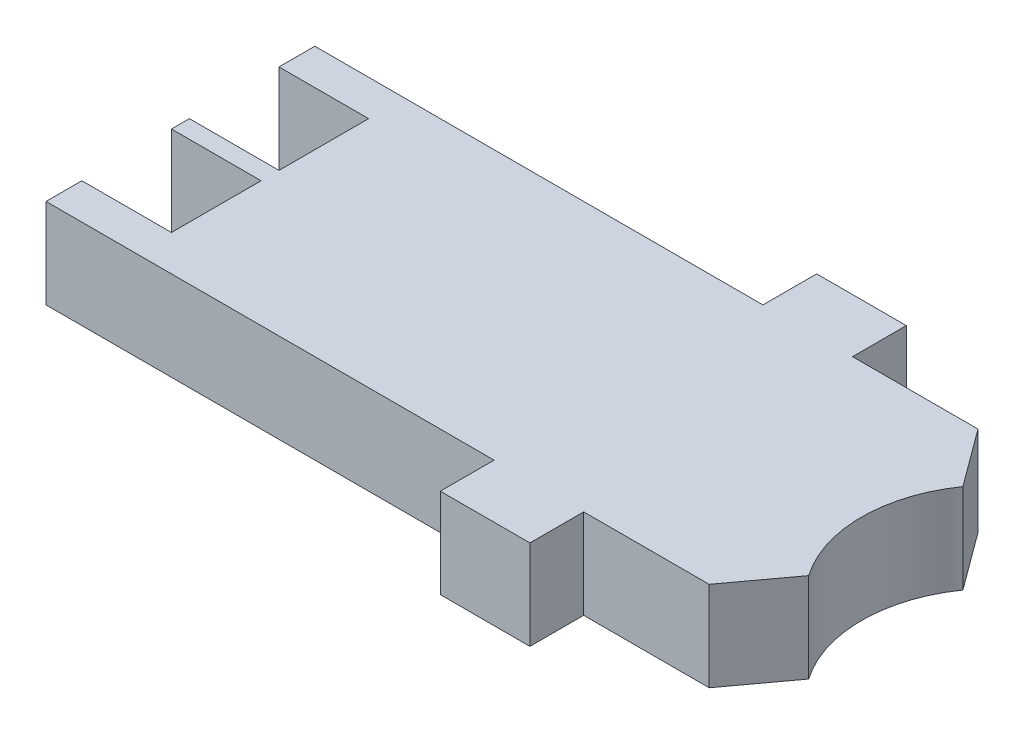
ISO-10303-21;
HEADER;
FILE_DESCRIPTION(('STEP AP214'),'2;1');
FILE_NAME('part.step','',(''),(''),'','','');
FILE_SCHEMA(('AUTOMOTIVE_DESIGN { 1 0 10303 214 1 1 1 1 }'));
ENDSEC;
DATA;
#1=APPLICATION_CONTEXT('core data for automotive mechanical design processes');
#2=APPLICATION_PROTOCOL_DEFINITION('international standard','automotive_design',2000,#1);
#3=PRODUCT_CONTEXT('',#1,'mechanical');
#4=PRODUCT('Part','Part','',(#3));
#5=PRODUCT_RELATED_PRODUCT_CATEGORY('part','',(#4));
#6=PRODUCT_DEFINITION_FORMATION('','',#4);
#7=PRODUCT_DEFINITION_CONTEXT('part definition',#1,'design');
#8=PRODUCT_DEFINITION('design','',#6,#7);
#9=PRODUCT_DEFINITION_SHAPE('','',#8);
#10=(LENGTH_UNIT() NAMED_UNIT(*) SI_UNIT(.MILLI.,.METRE.));
#11=(NAMED_UNIT(*) PLANE_ANGLE_UNIT() SI_UNIT($,.RADIAN.));
#12=(NAMED_UNIT(*) SI_UNIT($,.STERADIAN.) SOLID_ANGLE_UNIT());
#13=UNCERTAINTY_MEASURE_WITH_UNIT(LENGTH_MEASURE(1.E-05),#10,'distance_accuracy_value','');
#14=(GEOMETRIC_REPRESENTATION_CONTEXT(3) GLOBAL_UNCERTAINTY_ASSIGNED_CONTEXT((#13)) GLOBAL_UNIT_ASSIGNED_CONTEXT((#10,
#11,#12)) REPRESENTATION_CONTEXT('',''));
#15=CARTESIAN_POINT('',(0.,0.,0.));
#16=DIRECTION('',(0.,0.,1.));
#17=DIRECTION('',(1.,0.,0.));
#18=AXIS2_PLACEMENT_3D('',#15,#16,#17);
#19=CARTESIAN_POINT('',(-20.,5.,-7.5));
#20=DIRECTION('',(1.,0.,0.));
#21=DIRECTION('',(0.,0.,-1.));
#22=AXIS2_PLACEMENT_3D('',#19,#20,#21);
#23=PLANE('',#22);
#24=DIRECTION('',(0.,1.,0.));
#25=VECTOR('',#24,1.);
#26=CARTESIAN_POINT('',(-20.,0.,0.5));
#27=LINE('',#26,#25);
#28=CARTESIAN_POINT('',(-20.,0.,0.5));
#29=VERTEX_POINT('',#28);
#30=CARTESIAN_POINT('',(-20.,5.,0.499999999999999));
#31=VERTEX_POINT('',#30);
#32=EDGE_CURVE('E236',#29,#31,#27,.T.);
#33=ORIENTED_EDGE('',*,*,#32,.T.);
#34=DIRECTION('',(0.,0.,-1.));
#35=VECTOR('',#34,1.);
#36=CARTESIAN_POINT('',(-20.,5.,-7.5));
#37=LINE('',#36,#35);
#38=CARTESIAN_POINT('',(-20.,5.,-0.499999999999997));
#39=VERTEX_POINT('',#38);
#40=EDGE_CURVE('E35',#39,#31,#37,.F.);
#41=ORIENTED_EDGE('',*,*,#40,.F.);
#42=DIRECTION('',(0.,1.,0.));
#43=VECTOR('',#42,1.);
#44=CARTESIAN_POINT('',(-20.,0.,-0.499999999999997));
#45=LINE('',#44,#43);
#46=CARTESIAN_POINT('',(-20.,0.,-0.499999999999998));
#47=VERTEX_POINT('',#46);
#48=EDGE_CURVE('E127',#39,#47,#45,.F.);
#49=ORIENTED_EDGE('',*,*,#48,.T.);
#50=DIRECTION('',(0.,0.,1.));
#51=VECTOR('',#50,1.);
#52=CARTESIAN_POINT('',(-20.,0.,0.));
#53=LINE('',#52,#51);
#54=EDGE_CURVE('E241',#47,#29,#53,.T.);
#55=ORIENTED_EDGE('',*,*,#54,.T.);
#56=EDGE_LOOP('',(#33,#41,#49,#55));
#57=FACE_BOUND('',#56,.T.);
#58=ADVANCED_FACE('F17',(#57),#23,.F.);
#59=CARTESIAN_POINT('',(0.,0.,0.));
#60=DIRECTION('',(0.,1.,0.));
#61=DIRECTION('',(0.,0.,1.));
#62=AXIS2_PLACEMENT_3D('',#59,#60,#61);
#63=PLANE('',#62);
#64=DIRECTION('',(-1.,0.,0.));
#65=VECTOR('',#64,1.);
#66=CARTESIAN_POINT('',(-20.,0.,0.5));
#67=LINE('',#66,#65);
#68=CARTESIAN_POINT('',(-15.,0.,0.5));
#69=VERTEX_POINT('',#68);
#70=EDGE_CURVE('E239',#69,#29,#67,.T.);
#71=ORIENTED_EDGE('',*,*,#70,.T.);
#72=ORIENTED_EDGE('',*,*,#54,.F.);
#73=DIRECTION('',(1.,0.,0.));
#74=VECTOR('',#73,1.);
#75=CARTESIAN_POINT('',(-20.,0.,-0.499999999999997));
#76=LINE('',#75,#74);
#77=CARTESIAN_POINT('',(-15.,0.,-0.499999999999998));
#78=VERTEX_POINT('',#77);
#79=EDGE_CURVE('E251',#47,#78,#76,.T.);
#80=ORIENTED_EDGE('',*,*,#79,.T.);
#81=DIRECTION('',(0.,0.,-1.));
#82=VECTOR('',#81,1.);
#83=CARTESIAN_POINT('',(-15.,0.,-5.5));
#84=LINE('',#83,#82);
#85=CARTESIAN_POINT('',(-15.,0.,-5.5));
#86=VERTEX_POINT('',#85);
#87=EDGE_CURVE('E136',#78,#86,#84,.T.);
#88=ORIENTED_EDGE('',*,*,#87,.T.);
#89=DIRECTION('',(-1.,0.,0.));
#90=VECTOR('',#89,1.);
#91=CARTESIAN_POINT('',(-20.,0.,-5.5));
#92=LINE('',#91,#90);
#93=CARTESIAN_POINT('',(-20.,0.,-5.5));
#94=VERTEX_POINT('',#93);
#95=EDGE_CURVE('E289',#86,#94,#92,.T.);
#96=ORIENTED_EDGE('',*,*,#95,.T.);
#97=DIRECTION('',(0.,0.,-1.));
#98=VECTOR('',#97,1.);
#99=CARTESIAN_POINT('',(-20.,0.,-7.5));
#100=LINE('',#99,#98);
#101=CARTESIAN_POINT('',(-20.,0.,-7.5));
#102=VERTEX_POINT('',#101);
#103=EDGE_CURVE('E291',#94,#102,#100,.T.);
#104=ORIENTED_EDGE('',*,*,#103,.T.);
#105=DIRECTION('',(1.,0.,0.));
#106=VECTOR('',#105,1.);
#107=CARTESIAN_POINT('',(-20.,0.,-7.5));
#108=LINE('',#107,#106);
#109=CARTESIAN_POINT('',(5.00000000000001,0.,-7.5));
#110=VERTEX_POINT('',#109);
#111=EDGE_CURVE('E300',#102,#110,#108,.T.);
#112=ORIENTED_EDGE('',*,*,#111,.T.);
#113=DIRECTION('',(0.,0.,1.));
#114=VECTOR('',#113,1.);
#115=CARTESIAN_POINT('',(5.00000000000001,0.,-10.5));
#116=LINE('',#115,#114);
#117=CARTESIAN_POINT('',(5.00000000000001,0.,-10.5));
#118=VERTEX_POINT('',#117);
#119=EDGE_CURVE('E302',#118,#110,#116,.T.);
#120=ORIENTED_EDGE('',*,*,#119,.F.);
#121=DIRECTION('',(-1.,0.,0.));
#122=VECTOR('',#121,1.);
#123=CARTESIAN_POINT('',(5.00000000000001,0.,-10.5));
#124=LINE('',#123,#122);
#125=CARTESIAN_POINT('',(10.,0.,-10.5));
#126=VERTEX_POINT('',#125);
#127=EDGE_CURVE('E176',#126,#118,#124,.T.);
#128=ORIENTED_EDGE('',*,*,#127,.F.);
#129=DIRECTION('',(0.,0.,-1.));
#130=VECTOR('',#129,1.);
#131=CARTESIAN_POINT('',(10.,0.,-10.5));
#132=LINE('',#131,#130);
#133=CARTESIAN_POINT('',(10.,0.,-7.5));
#134=VERTEX_POINT('',#133);
#135=EDGE_CURVE('E172',#134,#126,#132,.T.);
#136=ORIENTED_EDGE('',*,*,#135,.F.);
#137=DIRECTION('',(1.,0.,0.));
#138=VECTOR('',#137,1.);
#139=CARTESIAN_POINT('',(-20.,0.,-7.5));
#140=LINE('',#139,#138);
#141=CARTESIAN_POINT('',(17.,0.,-7.5));
#142=VERTEX_POINT('',#141);
#143=EDGE_CURVE('E160',#134,#142,#140,.T.);
#144=ORIENTED_EDGE('',*,*,#143,.T.);
#145=DIRECTION('',(-0.593007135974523,0.,-0.805197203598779));
#146=VECTOR('',#145,1.);
#147=CARTESIAN_POINT('',(20.,0.,-3.42653871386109));
#148=LINE('',#147,#146);
#149=CARTESIAN_POINT('',(19.3558799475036,0.,-4.30113807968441));
#150=VERTEX_POINT('',#149);
#151=EDGE_CURVE('E169',#150,#142,#148,.T.);
#152=ORIENTED_EDGE('',*,*,#151,.F.);
#153=CARTESIAN_POINT('',(25.5,0.,0.));
#154=DIRECTION('',(0.,1.,0.));
#155=DIRECTION('',(0.,0.,1.));
#156=AXIS2_PLACEMENT_3D('',#153,#154,#155);
#157=CIRCLE('',#156,7.5);
#158=CARTESIAN_POINT('',(19.3558799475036,0.,4.30113807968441));
#159=VERTEX_POINT('',#158);
#160=EDGE_CURVE('E20',#150,#159,#157,.T.);
#161=ORIENTED_EDGE('',*,*,#160,.T.);
#162=DIRECTION('',(-0.593007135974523,0.,0.805197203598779));
#163=VECTOR('',#162,1.);
#164=CARTESIAN_POINT('',(20.,0.,3.42653871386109));
#165=LINE('',#164,#163);
#166=CARTESIAN_POINT('',(17.,0.,7.5));
#167=VERTEX_POINT('',#166);
#168=EDGE_CURVE('E192',#159,#167,#165,.T.);
#169=ORIENTED_EDGE('',*,*,#168,.T.);
#170=DIRECTION('',(-1.,0.,0.));
#171=VECTOR('',#170,1.);
#172=CARTESIAN_POINT('',(-20.,0.,7.5));
#173=LINE('',#172,#171);
#174=CARTESIAN_POINT('',(10.,0.,7.5));
#175=VERTEX_POINT('',#174);
#176=EDGE_CURVE('E72',#167,#175,#173,.T.);
#177=ORIENTED_EDGE('',*,*,#176,.T.);
#178=DIRECTION('',(0.,0.,-1.));
#179=VECTOR('',#178,1.);
#180=CARTESIAN_POINT('',(10.,0.,-10.5));
#181=LINE('',#180,#179);
#182=CARTESIAN_POINT('',(10.,0.,10.5));
#183=VERTEX_POINT('',#182);
#184=EDGE_CURVE('E201',#183,#175,#181,.T.);
#185=ORIENTED_EDGE('',*,*,#184,.F.);
#186=DIRECTION('',(1.,0.,0.));
#187=VECTOR('',#186,1.);
#188=CARTESIAN_POINT('',(5.00000000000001,0.,10.5));
#189=LINE('',#188,#187);
#190=CARTESIAN_POINT('',(5.00000000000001,0.,10.5));
#191=VERTEX_POINT('',#190);
#192=EDGE_CURVE('E206',#191,#183,#189,.T.);
#193=ORIENTED_EDGE('',*,*,#192,.F.);
#194=DIRECTION('',(0.,0.,1.));
#195=VECTOR('',#194,1.);
#196=CARTESIAN_POINT('',(5.00000000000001,0.,-10.5));
#197=LINE('',#196,#195);
#198=CARTESIAN_POINT('',(5.00000000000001,0.,7.5));
#199=VERTEX_POINT('',#198);
#200=EDGE_CURVE('E209',#199,#191,#197,.T.);
#201=ORIENTED_EDGE('',*,*,#200,.F.);
#202=DIRECTION('',(-1.,0.,0.));
#203=VECTOR('',#202,1.);
#204=CARTESIAN_POINT('',(-20.,0.,7.5));
#205=LINE('',#204,#203);
#206=CARTESIAN_POINT('',(-20.,0.,7.5));
#207=VERTEX_POINT('',#206);
#208=EDGE_CURVE('E217',#199,#207,#205,.T.);
#209=ORIENTED_EDGE('',*,*,#208,.T.);
#210=DIRECTION('',(0.,0.,-1.));
#211=VECTOR('',#210,1.);
#212=CARTESIAN_POINT('',(-20.,0.,-7.5));
#213=LINE('',#212,#211);
#214=CARTESIAN_POINT('',(-20.,0.,5.5));
#215=VERTEX_POINT('',#214);
#216=EDGE_CURVE('E223',#207,#215,#213,.T.);
#217=ORIENTED_EDGE('',*,*,#216,.T.);
#218=DIRECTION('',(1.,0.,0.));
#219=VECTOR('',#218,1.);
#220=CARTESIAN_POINT('',(-20.,0.,5.5));
#221=LINE('',#220,#219);
#222=CARTESIAN_POINT('',(-15.,0.,5.5));
#223=VERTEX_POINT('',#222);
#224=EDGE_CURVE('E229',#215,#223,#221,.T.);
#225=ORIENTED_EDGE('',*,*,#224,.T.);
#226=DIRECTION('',(0.,0.,-1.));
#227=VECTOR('',#226,1.);
#228=CARTESIAN_POINT('',(-15.,0.,5.5));
#229=LINE('',#228,#227);
#230=EDGE_CURVE('E234',#223,#69,#229,.T.);
#231=ORIENTED_EDGE('',*,*,#230,.T.);
#232=EDGE_LOOP('',(#71,#72,#80,#88,#96,#104,#112,#120,#128,#136,#144,#152,#161,#169,#177,#185,
#193,#201,#209,#217,#225,#231));
#233=FACE_BOUND('',#232,.T.);
#234=ADVANCED_FACE('F174',(#233),#63,.F.);
#235=CARTESIAN_POINT('',(-20.,0.,0.5));
#236=DIRECTION('',(0.,0.,-1.));
#237=DIRECTION('',(-1.,0.,0.));
#238=AXIS2_PLACEMENT_3D('',#235,#236,#237);
#239=PLANE('',#238);
#240=ORIENTED_EDGE('',*,*,#32,.F.);
#241=ORIENTED_EDGE('',*,*,#70,.F.);
#242=DIRECTION('',(0.,1.,0.));
#243=VECTOR('',#242,1.);
#244=CARTESIAN_POINT('',(-15.,0.,0.5));
#245=LINE('',#244,#243);
#246=CARTESIAN_POINT('',(-15.,5.,0.5));
#247=VERTEX_POINT('',#246);
#248=EDGE_CURVE('E231',#69,#247,#245,.T.);
#249=ORIENTED_EDGE('',*,*,#248,.T.);
#250=DIRECTION('',(1.,0.,0.));
#251=VECTOR('',#250,1.);
#252=CARTESIAN_POINT('',(0.,5.,0.5));
#253=LINE('',#252,#251);
#254=EDGE_CURVE('E282',#31,#247,#253,.T.);
#255=ORIENTED_EDGE('',*,*,#254,.F.);
#256=EDGE_LOOP('',(#240,#241,#249,#255));
#257=FACE_BOUND('',#256,.T.);
#258=ADVANCED_FACE('F441',(#257),#239,.F.);
#259=CARTESIAN_POINT('',(-15.,0.,5.5));
#260=DIRECTION('',(1.,0.,0.));
#261=DIRECTION('',(0.,0.,-1.));
#262=AXIS2_PLACEMENT_3D('',#259,#260,#261);
#263=PLANE('',#262);
#264=ORIENTED_EDGE('',*,*,#248,.F.);
#265=ORIENTED_EDGE('',*,*,#230,.F.);
#266=DIRECTION('',(0.,1.,0.));
#267=VECTOR('',#266,1.);
#268=CARTESIAN_POINT('',(-15.,0.,5.5));
#269=LINE('',#268,#267);
#270=CARTESIAN_POINT('',(-15.,5.,5.5));
#271=VERTEX_POINT('',#270);
#272=EDGE_CURVE('E226',#223,#271,#269,.T.);
#273=ORIENTED_EDGE('',*,*,#272,.T.);
#274=DIRECTION('',(0.,0.,1.));
#275=VECTOR('',#274,1.);
#276=CARTESIAN_POINT('',(-15.,5.,0.));
#277=LINE('',#276,#275);
#278=EDGE_CURVE('E374',#247,#271,#277,.T.);
#279=ORIENTED_EDGE('',*,*,#278,.F.);
#280=EDGE_LOOP('',(#264,#265,#273,#279));
#281=FACE_BOUND('',#280,.T.);
#282=ADVANCED_FACE('F437',(#281),#263,.F.);
#283=CARTESIAN_POINT('',(-20.,0.,5.5));
#284=DIRECTION('',(0.,0.,1.));
#285=DIRECTION('',(1.,0.,0.));
#286=AXIS2_PLACEMENT_3D('',#283,#284,#285);
#287=PLANE('',#286);
#288=ORIENTED_EDGE('',*,*,#272,.F.);
#289=ORIENTED_EDGE('',*,*,#224,.F.);
#290=DIRECTION('',(0.,1.,0.));
#291=VECTOR('',#290,1.);
#292=CARTESIAN_POINT('',(-20.,5.,5.5));
#293=LINE('',#292,#291);
#294=CARTESIAN_POINT('',(-20.,5.,5.5));
#295=VERTEX_POINT('',#294);
#296=EDGE_CURVE('E225',#215,#295,#293,.T.);
#297=ORIENTED_EDGE('',*,*,#296,.T.);
#298=DIRECTION('',(1.,0.,0.));
#299=VECTOR('',#298,1.);
#300=CARTESIAN_POINT('',(0.,5.,5.5));
#301=LINE('',#300,#299);
#302=EDGE_CURVE('E366',#271,#295,#301,.F.);
#303=ORIENTED_EDGE('',*,*,#302,.F.);
#304=EDGE_LOOP('',(#288,#289,#297,#303));
#305=FACE_BOUND('',#304,.T.);
#306=ADVANCED_FACE('F428',(#305),#287,.F.);
#307=CARTESIAN_POINT('',(-20.,5.,-7.5));
#308=DIRECTION('',(1.,0.,0.));
#309=DIRECTION('',(0.,0.,-1.));
#310=AXIS2_PLACEMENT_3D('',#307,#308,#309);
#311=PLANE('',#310);
#312=ORIENTED_EDGE('',*,*,#296,.F.);
#313=ORIENTED_EDGE('',*,*,#216,.F.);
#314=DIRECTION('',(0.,1.,0.));
#315=VECTOR('',#314,1.);
#316=CARTESIAN_POINT('',(-20.,5.,7.5));
#317=LINE('',#316,#315);
#318=CARTESIAN_POINT('',(-20.,5.,7.5));
#319=VERTEX_POINT('',#318);
#320=EDGE_CURVE('E220',#207,#319,#317,.T.);
#321=ORIENTED_EDGE('',*,*,#320,.T.);
#322=DIRECTION('',(0.,0.,1.));
#323=VECTOR('',#322,1.);
#324=CARTESIAN_POINT('',(-20.,5.,0.));
#325=LINE('',#324,#323);
#326=EDGE_CURVE('E358',#295,#319,#325,.T.);
#327=ORIENTED_EDGE('',*,*,#326,.F.);
#328=EDGE_LOOP('',(#312,#313,#321,#327));
#329=FACE_BOUND('',#328,.T.);
#330=ADVANCED_FACE('F431',(#329),#311,.F.);
#331=CARTESIAN_POINT('',(-20.,5.,7.5));
#332=DIRECTION('',(0.,0.,-1.));
#333=DIRECTION('',(-1.,0.,0.));
#334=AXIS2_PLACEMENT_3D('',#331,#332,#333);
#335=PLANE('',#334);
#336=DIRECTION('',(0.,1.,0.));
#337=VECTOR('',#336,1.);
#338=CARTESIAN_POINT('',(5.00000000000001,-21.5870331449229,7.5));
#339=LINE('',#338,#337);
#340=CARTESIAN_POINT('',(5.00000000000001,5.,7.5));
#341=VERTEX_POINT('',#340);
#342=EDGE_CURVE('E214',#341,#199,#339,.F.);
#343=ORIENTED_EDGE('',*,*,#342,.F.);
#344=DIRECTION('',(1.,0.,0.));
#345=VECTOR('',#344,1.);
#346=CARTESIAN_POINT('',(0.,5.,7.5));
#347=LINE('',#346,#345);
#348=EDGE_CURVE('E349',#319,#341,#347,.T.);
#349=ORIENTED_EDGE('',*,*,#348,.F.);
#350=ORIENTED_EDGE('',*,*,#320,.F.);
#351=ORIENTED_EDGE('',*,*,#208,.F.);
#352=EDGE_LOOP('',(#343,#349,#350,#351));
#353=FACE_BOUND('',#352,.T.);
#354=ADVANCED_FACE('F420',(#353),#335,.F.);
#355=CARTESIAN_POINT('',(5.00000000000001,-21.5870331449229,-10.5));
#356=DIRECTION('',(-1.,0.,0.));
#357=DIRECTION('',(0.,0.,1.));
#358=AXIS2_PLACEMENT_3D('',#355,#356,#357);
#359=PLANE('',#358);
#360=DIRECTION('',(0.,1.,0.));
#361=VECTOR('',#360,1.);
#362=CARTESIAN_POINT('',(5.00000000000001,-21.5870331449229,10.5));
#363=LINE('',#362,#361);
#364=CARTESIAN_POINT('',(5.00000000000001,5.,10.5));
#365=VERTEX_POINT('',#364);
#366=EDGE_CURVE('E208',#365,#191,#363,.F.);
#367=ORIENTED_EDGE('',*,*,#366,.F.);
#368=DIRECTION('',(0.,0.,1.));
#369=VECTOR('',#368,1.);
#370=CARTESIAN_POINT('',(5.00000000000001,5.,0.));
#371=LINE('',#370,#369);
#372=EDGE_CURVE('E340',#341,#365,#371,.T.);
#373=ORIENTED_EDGE('',*,*,#372,.F.);
#374=ORIENTED_EDGE('',*,*,#342,.T.);
#375=ORIENTED_EDGE('',*,*,#200,.T.);
#376=EDGE_LOOP('',(#367,#373,#374,#375));
#377=FACE_BOUND('',#376,.T.);
#378=ADVANCED_FACE('F416',(#377),#359,.T.);
#379=CARTESIAN_POINT('',(5.00000000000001,-21.5870331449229,10.5));
#380=DIRECTION('',(0.,0.,1.));
#381=DIRECTION('',(1.,0.,0.));
#382=AXIS2_PLACEMENT_3D('',#379,#380,#381);
#383=PLANE('',#382);
#384=DIRECTION('',(1.,0.,0.));
#385=VECTOR('',#384,1.);
#386=CARTESIAN_POINT('',(0.,5.,10.5));
#387=LINE('',#386,#385);
#388=CARTESIAN_POINT('',(10.,5.,10.5));
#389=VERTEX_POINT('',#388);
#390=EDGE_CURVE('E331',#365,#389,#387,.T.);
#391=ORIENTED_EDGE('',*,*,#390,.F.);
#392=ORIENTED_EDGE('',*,*,#366,.T.);
#393=ORIENTED_EDGE('',*,*,#192,.T.);
#394=DIRECTION('',(0.,1.,0.));
#395=VECTOR('',#394,1.);
#396=CARTESIAN_POINT('',(10.,-21.5870331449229,10.5));
#397=LINE('',#396,#395);
#398=EDGE_CURVE('E203',#389,#183,#397,.F.);
#399=ORIENTED_EDGE('',*,*,#398,.F.);
#400=EDGE_LOOP('',(#391,#392,#393,#399));
#401=FACE_BOUND('',#400,.T.);
#402=ADVANCED_FACE('F413',(#401),#383,.T.);
#403=CARTESIAN_POINT('',(10.,-21.5870331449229,-10.5));
#404=DIRECTION('',(1.,0.,0.));
#405=DIRECTION('',(0.,0.,-1.));
#406=AXIS2_PLACEMENT_3D('',#403,#404,#405);
#407=PLANE('',#406);
#408=ORIENTED_EDGE('',*,*,#398,.T.);
#409=ORIENTED_EDGE('',*,*,#184,.T.);
#410=DIRECTION('',(0.,1.,0.));
#411=VECTOR('',#410,1.);
#412=CARTESIAN_POINT('',(10.,5.,7.5));
#413=LINE('',#412,#411);
#414=CARTESIAN_POINT('',(10.,5.,7.5));
#415=VERTEX_POINT('',#414);
#416=EDGE_CURVE('E198',#175,#415,#413,.T.);
#417=ORIENTED_EDGE('',*,*,#416,.T.);
#418=DIRECTION('',(0.,0.,1.));
#419=VECTOR('',#418,1.);
#420=CARTESIAN_POINT('',(10.,5.,0.));
#421=LINE('',#420,#419);
#422=EDGE_CURVE('E274',#389,#415,#421,.F.);
#423=ORIENTED_EDGE('',*,*,#422,.F.);
#424=EDGE_LOOP('',(#408,#409,#417,#423));
#425=FACE_BOUND('',#424,.T.);
#426=ADVANCED_FACE('F410',(#425),#407,.T.);
#427=CARTESIAN_POINT('',(-20.,5.,7.5));
#428=DIRECTION('',(0.,0.,-1.));
#429=DIRECTION('',(-1.,0.,0.));
#430=AXIS2_PLACEMENT_3D('',#427,#428,#429);
#431=PLANE('',#430);
#432=DIRECTION('',(0.,1.,0.));
#433=VECTOR('',#432,1.);
#434=CARTESIAN_POINT('',(17.,0.,7.5));
#435=LINE('',#434,#433);
#436=CARTESIAN_POINT('',(17.,5.,7.5));
#437=VERTEX_POINT('',#436);
#438=EDGE_CURVE('E194',#167,#437,#435,.T.);
#439=ORIENTED_EDGE('',*,*,#438,.T.);
#440=DIRECTION('',(1.,0.,0.));
#441=VECTOR('',#440,1.);
#442=CARTESIAN_POINT('',(0.,5.,7.5));
#443=LINE('',#442,#441);
#444=EDGE_CURVE('E270',#415,#437,#443,.T.);
#445=ORIENTED_EDGE('',*,*,#444,.F.);
#446=ORIENTED_EDGE('',*,*,#416,.F.);
#447=ORIENTED_EDGE('',*,*,#176,.F.);
#448=EDGE_LOOP('',(#439,#445,#446,#447));
#449=FACE_BOUND('',#448,.T.);
#450=ADVANCED_FACE('F407',(#449),#431,.F.);
#451=CARTESIAN_POINT('',(20.,0.,3.42653871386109));
#452=DIRECTION('',(-0.805197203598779,0.,-0.593007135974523));
#453=DIRECTION('',(-0.593007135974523,0.,0.805197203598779));
#454=AXIS2_PLACEMENT_3D('',#451,#452,#453);
#455=PLANE('',#454);
#456=DIRECTION('',(0.,1.,0.));
#457=VECTOR('',#456,1.);
#458=CARTESIAN_POINT('',(19.3558799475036,0.,4.30113807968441));
#459=LINE('',#458,#457);
#460=CARTESIAN_POINT('',(19.3558799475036,5.,4.30113807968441));
#461=VERTEX_POINT('',#460);
#462=EDGE_CURVE('E314',#159,#461,#459,.T.);
#463=ORIENTED_EDGE('',*,*,#462,.T.);
#464=DIRECTION('',(0.593007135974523,0.,-0.805197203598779));
#465=VECTOR('',#464,1.);
#466=CARTESIAN_POINT('',(17.,5.,7.5));
#467=LINE('',#466,#465);
#468=EDGE_CURVE('E263',#437,#461,#467,.T.);
#469=ORIENTED_EDGE('',*,*,#468,.F.);
#470=ORIENTED_EDGE('',*,*,#438,.F.);
#471=ORIENTED_EDGE('',*,*,#168,.F.);
#472=EDGE_LOOP('',(#463,#469,#470,#471));
#473=FACE_BOUND('',#472,.T.);
#474=ADVANCED_FACE('F403',(#473),#455,.F.);
#475=CARTESIAN_POINT('',(25.5,0.,0.));
#476=DIRECTION('',(0.,1.,0.));
#477=DIRECTION('',(0.,0.,1.));
#478=AXIS2_PLACEMENT_3D('',#475,#476,#477);
#479=CYLINDRICAL_SURFACE('',#478,7.5);
#480=CARTESIAN_POINT('',(25.5,5.,0.));
#481=DIRECTION('',(0.,1.,0.));
#482=DIRECTION('',(0.,0.,1.));
#483=AXIS2_PLACEMENT_3D('',#480,#481,#482);
#484=CIRCLE('',#483,7.5);
#485=CARTESIAN_POINT('',(19.3558799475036,5.,-4.30113807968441));
#486=VERTEX_POINT('',#485);
#487=EDGE_CURVE('E260',#461,#486,#484,.F.);
#488=ORIENTED_EDGE('',*,*,#487,.F.);
#489=ORIENTED_EDGE('',*,*,#462,.F.);
#490=ORIENTED_EDGE('',*,*,#160,.F.);
#491=DIRECTION('',(0.,1.,0.));
#492=VECTOR('',#491,1.);
#493=CARTESIAN_POINT('',(19.3558799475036,0.,-4.30113807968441));
#494=LINE('',#493,#492);
#495=EDGE_CURVE('E311',#486,#150,#494,.F.);
#496=ORIENTED_EDGE('',*,*,#495,.F.);
#497=EDGE_LOOP('',(#488,#489,#490,#496));
#498=FACE_BOUND('',#497,.T.);
#499=ADVANCED_FACE('F401',(#498),#479,.F.);
#500=CARTESIAN_POINT('',(20.,0.,-3.42653871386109));
#501=DIRECTION('',(0.805197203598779,0.,-0.593007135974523));
#502=DIRECTION('',(-0.593007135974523,0.,-0.805197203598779));
#503=AXIS2_PLACEMENT_3D('',#500,#501,#502);
#504=PLANE('',#503);
#505=DIRECTION('',(0.,1.,0.));
#506=VECTOR('',#505,1.);
#507=CARTESIAN_POINT('',(17.,5.,-7.5));
#508=LINE('',#507,#506);
#509=CARTESIAN_POINT('',(17.,5.,-7.5));
#510=VERTEX_POINT('',#509);
#511=EDGE_CURVE('E167',#142,#510,#508,.T.);
#512=ORIENTED_EDGE('',*,*,#511,.T.);
#513=DIRECTION('',(-0.593007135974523,0.,-0.805197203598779));
#514=VECTOR('',#513,1.);
#515=CARTESIAN_POINT('',(19.3558799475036,5.,-4.30113807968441));
#516=LINE('',#515,#514);
#517=EDGE_CURVE('E262',#486,#510,#516,.T.);
#518=ORIENTED_EDGE('',*,*,#517,.F.);
#519=ORIENTED_EDGE('',*,*,#495,.T.);
#520=ORIENTED_EDGE('',*,*,#151,.T.);
#521=EDGE_LOOP('',(#512,#518,#519,#520));
#522=FACE_BOUND('',#521,.T.);
#523=ADVANCED_FACE('F399',(#522),#504,.T.);
#524=CARTESIAN_POINT('',(-20.,5.,-7.5));
#525=DIRECTION('',(0.,0.,1.));
#526=DIRECTION('',(1.,0.,0.));
#527=AXIS2_PLACEMENT_3D('',#524,#525,#526);
#528=PLANE('',#527);
#529=ORIENTED_EDGE('',*,*,#143,.F.);
#530=DIRECTION('',(0.,1.,0.));
#531=VECTOR('',#530,1.);
#532=CARTESIAN_POINT('',(10.,-21.5870331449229,-7.5));
#533=LINE('',#532,#531);
#534=CARTESIAN_POINT('',(10.,5.,-7.5));
#535=VERTEX_POINT('',#534);
#536=EDGE_CURVE('E165',#535,#134,#533,.F.);
#537=ORIENTED_EDGE('',*,*,#536,.F.);
#538=DIRECTION('',(1.,0.,0.));
#539=VECTOR('',#538,1.);
#540=CARTESIAN_POINT('',(0.,5.,-7.5));
#541=LINE('',#540,#539);
#542=EDGE_CURVE('E268',#510,#535,#541,.F.);
#543=ORIENTED_EDGE('',*,*,#542,.F.);
#544=ORIENTED_EDGE('',*,*,#511,.F.);
#545=EDGE_LOOP('',(#529,#537,#543,#544));
#546=FACE_BOUND('',#545,.T.);
#547=ADVANCED_FACE('F162',(#546),#528,.F.);
#548=CARTESIAN_POINT('',(10.,-21.5870331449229,-10.5));
#549=DIRECTION('',(1.,0.,0.));
#550=DIRECTION('',(0.,0.,-1.));
#551=AXIS2_PLACEMENT_3D('',#548,#549,#550);
#552=PLANE('',#551);
#553=DIRECTION('',(0.,1.,0.));
#554=VECTOR('',#553,1.);
#555=CARTESIAN_POINT('',(10.,-21.5870331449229,-10.5));
#556=LINE('',#555,#554);
#557=CARTESIAN_POINT('',(10.,5.,-10.5));
#558=VERTEX_POINT('',#557);
#559=EDGE_CURVE('E308',#558,#126,#556,.F.);
#560=ORIENTED_EDGE('',*,*,#559,.F.);
#561=DIRECTION('',(0.,0.,1.));
#562=VECTOR('',#561,1.);
#563=CARTESIAN_POINT('',(10.,5.,0.));
#564=LINE('',#563,#562);
#565=EDGE_CURVE('E183',#535,#558,#564,.F.);
#566=ORIENTED_EDGE('',*,*,#565,.F.);
#567=ORIENTED_EDGE('',*,*,#536,.T.);
#568=ORIENTED_EDGE('',*,*,#135,.T.);
#569=EDGE_LOOP('',(#560,#566,#567,#568));
#570=FACE_BOUND('',#569,.T.);
#571=ADVANCED_FACE('F181',(#570),#552,.T.);
#572=CARTESIAN_POINT('',(5.00000000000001,-21.5870331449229,-10.5));
#573=DIRECTION('',(0.,0.,-1.));
#574=DIRECTION('',(-1.,0.,0.));
#575=AXIS2_PLACEMENT_3D('',#572,#573,#574);
#576=PLANE('',#575);
#577=DIRECTION('',(1.,0.,0.));
#578=VECTOR('',#577,1.);
#579=CARTESIAN_POINT('',(0.,5.,-10.5));
#580=LINE('',#579,#578);
#581=CARTESIAN_POINT('',(5.00000000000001,5.,-10.5));
#582=VERTEX_POINT('',#581);
#583=EDGE_CURVE('E474',#558,#582,#580,.F.);
#584=ORIENTED_EDGE('',*,*,#583,.F.);
#585=ORIENTED_EDGE('',*,*,#559,.T.);
#586=ORIENTED_EDGE('',*,*,#127,.T.);
#587=DIRECTION('',(0.,1.,0.));
#588=VECTOR('',#587,1.);
#589=CARTESIAN_POINT('',(5.00000000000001,-21.5870331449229,-10.5));
#590=LINE('',#589,#588);
#591=EDGE_CURVE('E305',#582,#118,#590,.F.);
#592=ORIENTED_EDGE('',*,*,#591,.F.);
#593=EDGE_LOOP('',(#584,#585,#586,#592));
#594=FACE_BOUND('',#593,.T.);
#595=ADVANCED_FACE('F475',(#594),#576,.T.);
#596=CARTESIAN_POINT('',(5.00000000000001,-21.5870331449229,-10.5));
#597=DIRECTION('',(-1.,0.,0.));
#598=DIRECTION('',(0.,0.,1.));
#599=AXIS2_PLACEMENT_3D('',#596,#597,#598);
#600=PLANE('',#599);
#601=ORIENTED_EDGE('',*,*,#591,.T.);
#602=ORIENTED_EDGE('',*,*,#119,.T.);
#603=DIRECTION('',(0.,1.,0.));
#604=VECTOR('',#603,1.);
#605=CARTESIAN_POINT('',(5.00000000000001,5.,-7.5));
#606=LINE('',#605,#604);
#607=CARTESIAN_POINT('',(5.00000000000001,5.,-7.5));
#608=VERTEX_POINT('',#607);
#609=EDGE_CURVE('E297',#110,#608,#606,.T.);
#610=ORIENTED_EDGE('',*,*,#609,.T.);
#611=DIRECTION('',(0.,0.,1.));
#612=VECTOR('',#611,1.);
#613=CARTESIAN_POINT('',(5.00000000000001,5.,0.));
#614=LINE('',#613,#612);
#615=EDGE_CURVE('E478',#582,#608,#614,.T.);
#616=ORIENTED_EDGE('',*,*,#615,.F.);
#617=EDGE_LOOP('',(#601,#602,#610,#616));
#618=FACE_BOUND('',#617,.T.);
#619=ADVANCED_FACE('F498',(#618),#600,.T.);
#620=CARTESIAN_POINT('',(-20.,5.,-7.5));
#621=DIRECTION('',(0.,0.,1.));
#622=DIRECTION('',(1.,0.,0.));
#623=AXIS2_PLACEMENT_3D('',#620,#621,#622);
#624=PLANE('',#623);
#625=ORIENTED_EDGE('',*,*,#609,.F.);
#626=ORIENTED_EDGE('',*,*,#111,.F.);
#627=DIRECTION('',(0.,1.,0.));
#628=VECTOR('',#627,1.);
#629=CARTESIAN_POINT('',(-20.,5.,-7.5));
#630=LINE('',#629,#628);
#631=CARTESIAN_POINT('',(-20.,5.,-7.5));
#632=VERTEX_POINT('',#631);
#633=EDGE_CURVE('E294',#102,#632,#630,.T.);
#634=ORIENTED_EDGE('',*,*,#633,.T.);
#635=DIRECTION('',(1.,0.,0.));
#636=VECTOR('',#635,1.);
#637=CARTESIAN_POINT('',(0.,5.,-7.5));
#638=LINE('',#637,#636);
#639=EDGE_CURVE('E483',#608,#632,#638,.F.);
#640=ORIENTED_EDGE('',*,*,#639,.F.);
#641=EDGE_LOOP('',(#625,#626,#634,#640));
#642=FACE_BOUND('',#641,.T.);
#643=ADVANCED_FACE('F499',(#642),#624,.F.);
#644=CARTESIAN_POINT('',(-20.,5.,-7.5));
#645=DIRECTION('',(1.,0.,0.));
#646=DIRECTION('',(0.,0.,-1.));
#647=AXIS2_PLACEMENT_3D('',#644,#645,#646);
#648=PLANE('',#647);
#649=DIRECTION('',(0.,1.,0.));
#650=VECTOR('',#649,1.);
#651=CARTESIAN_POINT('',(-20.,0.,-5.5));
#652=LINE('',#651,#650);
#653=CARTESIAN_POINT('',(-20.,5.,-5.5));
#654=VERTEX_POINT('',#653);
#655=EDGE_CURVE('E286',#94,#654,#652,.T.);
#656=ORIENTED_EDGE('',*,*,#655,.T.);
#657=DIRECTION('',(0.,0.,1.));
#658=VECTOR('',#657,1.);
#659=CARTESIAN_POINT('',(-20.,5.,0.));
#660=LINE('',#659,#658);
#661=EDGE_CURVE('E486',#632,#654,#660,.T.);
#662=ORIENTED_EDGE('',*,*,#661,.F.);
#663=ORIENTED_EDGE('',*,*,#633,.F.);
#664=ORIENTED_EDGE('',*,*,#103,.F.);
#665=EDGE_LOOP('',(#656,#662,#663,#664));
#666=FACE_BOUND('',#665,.T.);
#667=ADVANCED_FACE('F493',(#666),#648,.F.);
#668=CARTESIAN_POINT('',(-20.,0.,-5.5));
#669=DIRECTION('',(0.,0.,-1.));
#670=DIRECTION('',(-1.,0.,0.));
#671=AXIS2_PLACEMENT_3D('',#668,#669,#670);
#672=PLANE('',#671);
#673=ORIENTED_EDGE('',*,*,#655,.F.);
#674=ORIENTED_EDGE('',*,*,#95,.F.);
#675=DIRECTION('',(0.,1.,0.));
#676=VECTOR('',#675,1.);
#677=CARTESIAN_POINT('',(-15.,0.,-5.5));
#678=LINE('',#677,#676);
#679=CARTESIAN_POINT('',(-15.,5.,-5.5));
#680=VERTEX_POINT('',#679);
#681=EDGE_CURVE('E252',#86,#680,#678,.T.);
#682=ORIENTED_EDGE('',*,*,#681,.T.);
#683=DIRECTION('',(1.,0.,0.));
#684=VECTOR('',#683,1.);
#685=CARTESIAN_POINT('',(0.,5.,-5.5));
#686=LINE('',#685,#684);
#687=EDGE_CURVE('E458',#654,#680,#686,.T.);
#688=ORIENTED_EDGE('',*,*,#687,.F.);
#689=EDGE_LOOP('',(#673,#674,#682,#688));
#690=FACE_BOUND('',#689,.T.);
#691=ADVANCED_FACE('F456',(#690),#672,.F.);
#692=CARTESIAN_POINT('',(-15.,0.,-5.5));
#693=DIRECTION('',(1.,0.,0.));
#694=DIRECTION('',(0.,0.,-1.));
#695=AXIS2_PLACEMENT_3D('',#692,#693,#694);
#696=PLANE('',#695);
#697=ORIENTED_EDGE('',*,*,#681,.F.);
#698=ORIENTED_EDGE('',*,*,#87,.F.);
#699=DIRECTION('',(0.,1.,0.));
#700=VECTOR('',#699,1.);
#701=CARTESIAN_POINT('',(-15.,0.,-0.499999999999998));
#702=LINE('',#701,#700);
#703=CARTESIAN_POINT('',(-15.,5.,-0.499999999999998));
#704=VERTEX_POINT('',#703);
#705=EDGE_CURVE('E256',#78,#704,#702,.T.);
#706=ORIENTED_EDGE('',*,*,#705,.T.);
#707=DIRECTION('',(0.,0.,1.));
#708=VECTOR('',#707,1.);
#709=CARTESIAN_POINT('',(-15.,5.,0.));
#710=LINE('',#709,#708);
#711=EDGE_CURVE('E26',#680,#704,#710,.T.);
#712=ORIENTED_EDGE('',*,*,#711,.F.);
#713=EDGE_LOOP('',(#697,#698,#706,#712));
#714=FACE_BOUND('',#713,.T.);
#715=ADVANCED_FACE('F452',(#714),#696,.F.);
#716=CARTESIAN_POINT('',(-20.,0.,-0.499999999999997));
#717=DIRECTION('',(0.,0.,1.));
#718=DIRECTION('',(1.,0.,0.));
#719=AXIS2_PLACEMENT_3D('',#716,#717,#718);
#720=PLANE('',#719);
#721=ORIENTED_EDGE('',*,*,#705,.F.);
#722=ORIENTED_EDGE('',*,*,#79,.F.);
#723=ORIENTED_EDGE('',*,*,#48,.F.);
#724=DIRECTION('',(1.,0.,0.));
#725=VECTOR('',#724,1.);
#726=CARTESIAN_POINT('',(0.,5.,-0.499999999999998));
#727=LINE('',#726,#725);
#728=EDGE_CURVE('E11',#704,#39,#727,.F.);
#729=ORIENTED_EDGE('',*,*,#728,.F.);
#730=EDGE_LOOP('',(#721,#722,#723,#729));
#731=FACE_BOUND('',#730,.T.);
#732=ADVANCED_FACE('F448',(#731),#720,.F.);
#733=CARTESIAN_POINT('',(0.,5.,0.));
#734=DIRECTION('',(0.,1.,0.));
#735=DIRECTION('',(0.,0.,1.));
#736=AXIS2_PLACEMENT_3D('',#733,#734,#735);
#737=PLANE('',#736);
#738=ORIENTED_EDGE('',*,*,#728,.T.);
#739=ORIENTED_EDGE('',*,*,#40,.T.);
#740=ORIENTED_EDGE('',*,*,#254,.T.);
#741=ORIENTED_EDGE('',*,*,#278,.T.);
#742=ORIENTED_EDGE('',*,*,#302,.T.);
#743=ORIENTED_EDGE('',*,*,#326,.T.);
#744=ORIENTED_EDGE('',*,*,#348,.T.);
#745=ORIENTED_EDGE('',*,*,#372,.T.);
#746=ORIENTED_EDGE('',*,*,#390,.T.);
#747=ORIENTED_EDGE('',*,*,#422,.T.);
#748=ORIENTED_EDGE('',*,*,#444,.T.);
#749=ORIENTED_EDGE('',*,*,#468,.T.);
#750=ORIENTED_EDGE('',*,*,#487,.T.);
#751=ORIENTED_EDGE('',*,*,#517,.T.);
#752=ORIENTED_EDGE('',*,*,#542,.T.);
#753=ORIENTED_EDGE('',*,*,#565,.T.);
#754=ORIENTED_EDGE('',*,*,#583,.T.);
#755=ORIENTED_EDGE('',*,*,#615,.T.);
#756=ORIENTED_EDGE('',*,*,#639,.T.);
#757=ORIENTED_EDGE('',*,*,#661,.T.);
#758=ORIENTED_EDGE('',*,*,#687,.T.);
#759=ORIENTED_EDGE('',*,*,#711,.T.);
#760=EDGE_LOOP('',(#738,#739,#740,#741,#742,#743,#744,#745,#746,#747,#748,#749,#750,#751,#752,
#753,#754,#755,#756,#757,#758,#759));
#761=FACE_BOUND('',#760,.T.);
#762=ADVANCED_FACE('F432',(#761),#737,.T.);
#763=CLOSED_SHELL('',(#58,#234,#258,#282,#306,#330,#354,#378,#402,#426,#450,#474,#499,#523,#547,
#571,#595,#619,#643,#667,#691,#715,#732,#762));
#764=MANIFOLD_SOLID_BREP('B1',#763);
#765=ADVANCED_BREP_SHAPE_REPRESENTATION('',(#18,#764),#14);
#766=SHAPE_DEFINITION_REPRESENTATION(#9,#765);
ENDSEC;
END-ISO-10303-21;
